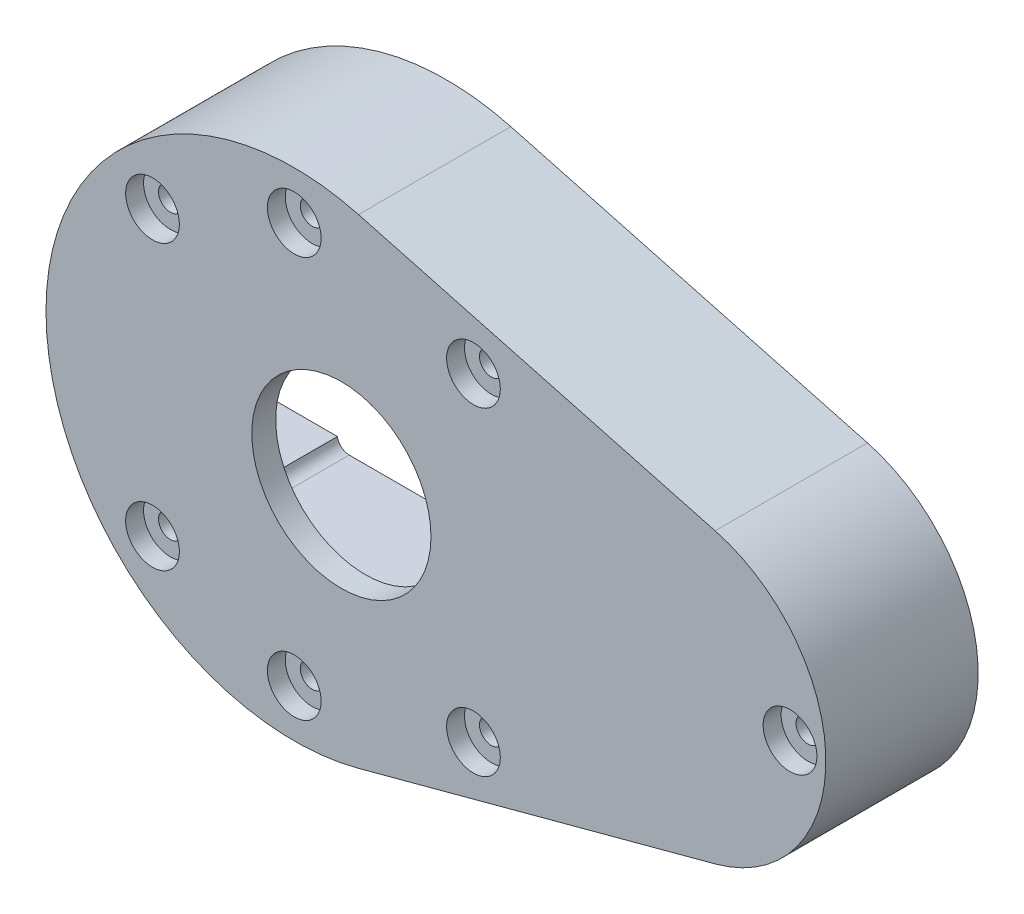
from build123d import *

# Parameters (mm, degrees)
SKETCH1_R           = 1
BOSS_EXTRUDE1_DEPTH = 12.75
BOSS_EXTRUDE2_START = -2
SKETCH2_R           = 1
BOSS_EXTRUDE2_DEPTH = 2
SKETCH3_R           = 7.5
CUT_EXTRUDE1_DEPTH  = 41.949636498
SKETCH4_R           = 2.25
CUT_EXTRUDE2_DEPTH  = 1.5


with BuildPart() as part:
    # Sketch1 → Boss-Extrude1 (new body)
    with BuildSketch(Plane.XY):
        with BuildLine():
            Line((23.635238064, 12.074072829), (-6.221168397, 20.074072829))
            ThreePointArc((-6.221168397, 20.074072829), (-32.382209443, 0), (-6.221168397, -20.074072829))
            Line((-6.221168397, -20.074072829), (23.635238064, -12.074072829))
            ThreePointArc((23.635238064, -12.074072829), (32.9, 0), (23.635238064, 12.074072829))
        make_face()
        with Locations((-23.466814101, -11.866814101)):
            Circle(SKETCH1_R, mode=Mode.SUBTRACT)
        with Locations((-11.6, -16.782209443)):
            Circle(SKETCH1_R, mode=Mode.SUBTRACT)
        with BuildLine():
            Line((27.75, 6.225), (27.75, -6.225))
            Line((27.75, -6.225), (27.75, -7.65))
            ThreePointArc((27.75, -7.65), (27.164213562, -9.064213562), (25.75, -9.65))
            Line((25.75, -9.65), (20.738685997, -9.65))
            ThreePointArc((20.738685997, -9.65), (20.401920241, -10.258287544), (19.75, -10.5))
            Line((19.75, -10.5), (-8.260025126, -10.5))
            Line((-8.260025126, -10.5), (-10.25, -10.5))
            Line((-10.25, -10.5), (-12.239974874, -10.5))
            Line((-12.239974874, -10.5), (-19.75, -10.5))
            ThreePointArc((-19.75, -10.5), (-20.401920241, -10.258287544), (-20.738685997, -9.65))
            Line((-20.738685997, -9.65), (-25.75, -9.65))
            ThreePointArc((-25.75, -9.65), (-27.164213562, -9.064213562), (-27.75, -7.65))
            Line((-27.75, -7.65), (-27.75, -6.225))
            Line((-27.75, -6.225), (-27.75, 6.225))
            Line((-27.75, 6.225), (-27.75, 7.65))
            ThreePointArc((-27.75, 7.65), (-27.164213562, 9.064213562), (-25.75, 9.65))
            Line((-25.75, 9.65), (-20.738685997, 9.65))
            ThreePointArc((-20.738685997, 9.65), (-20.401920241, 10.258287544), (-19.75, 10.5))
            Line((-19.75, 10.5), (-12.239974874, 10.5))
            Line((-12.239974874, 10.5), (-10.25, 10.5))
            Line((-10.25, 10.5), (-8.260025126, 10.5))
            Line((-8.260025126, 10.5), (19.75, 10.5))
            ThreePointArc((19.75, 10.5), (20.401920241, 10.258287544), (20.738685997, 9.65))
            Line((20.738685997, 9.65), (25.75, 9.65))
            ThreePointArc((25.75, 9.65), (27.164213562, 9.064213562), (27.75, 7.65))
            Line((27.75, 7.65), (27.75, 6.225))
        make_face(mode=Mode.SUBTRACT)
        with Locations((3.4, -13.354983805)):
            Circle(SKETCH1_R, mode=Mode.SUBTRACT)
        with Locations((-23.466814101, 11.866814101)):
            Circle(SKETCH1_R, mode=Mode.SUBTRACT)
        with Locations((-11.6, 16.782209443)):
            Circle(SKETCH1_R, mode=Mode.SUBTRACT)
        with Locations((29.9, 0)):
            Circle(SKETCH1_R, mode=Mode.SUBTRACT)
        with Locations((3.4, 13.354983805)):
            Circle(SKETCH1_R, mode=Mode.SUBTRACT)
    extrude(amount=BOSS_EXTRUDE1_DEPTH)

    # Sketch2 → Boss-Extrude2 (add)
    with BuildSketch(Plane.XY.offset(12.75).offset(BOSS_EXTRUDE2_START)):
        with BuildLine():
            Line((23.635238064, 12.074072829), (-6.221168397, 20.074072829))
            ThreePointArc((-6.221168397, 20.074072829), (-32.382209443, 0), (-6.221168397, -20.074072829))
            Line((-6.221168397, -20.074072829), (23.635238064, -12.074072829))
            ThreePointArc((23.635238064, -12.074072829), (32.9, 0), (23.635238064, 12.074072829))
        make_face()
        with Locations((-11.6, 16.782209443)):
            Circle(SKETCH2_R, mode=Mode.SUBTRACT)
        with Locations((3.4, 13.354983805)):
            Circle(SKETCH2_R, mode=Mode.SUBTRACT)
        with Locations((29.9, 0)):
            Circle(SKETCH2_R, mode=Mode.SUBTRACT)
        with Locations((3.4, -13.354983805)):
            Circle(SKETCH2_R, mode=Mode.SUBTRACT)
        with Locations((-11.6, -16.782209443)):
            Circle(SKETCH2_R, mode=Mode.SUBTRACT)
        with Locations((-23.466814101, -11.866814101)):
            Circle(SKETCH2_R, mode=Mode.SUBTRACT)
        with Locations((-23.466814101, 11.866814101)):
            Circle(SKETCH2_R, mode=Mode.SUBTRACT)
    extrude(amount=BOSS_EXTRUDE2_DEPTH)

    # Sketch3 → Cut-Extrude1 (cut, through all)
    with BuildSketch(Plane.XY.offset(12.75)):
        with Locations((-7.655940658, -0.25)):
            Circle(SKETCH3_R)
    extrude(amount=-CUT_EXTRUDE1_DEPTH, mode=Mode.SUBTRACT)

    # Sketch4 → Cut-Extrude2 (cut)
    with BuildSketch(Plane.XY.offset(12.75)):
        with Locations((-11.6, 16.782209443)):
            Circle(SKETCH4_R)
        with Locations((3.4, 13.354983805)):
            Circle(SKETCH4_R)
        with Locations((29.9, 0)):
            Circle(SKETCH4_R)
        with Locations((3.4, -13.354983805)):
            Circle(SKETCH4_R)
        with Locations((-11.6, -16.782209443)):
            Circle(SKETCH4_R)
        with Locations((-23.466814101, -11.866814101)):
            Circle(SKETCH4_R)
        with Locations((-23.466814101, 11.866814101)):
            Circle(SKETCH4_R)
    extrude(amount=-CUT_EXTRUDE2_DEPTH, mode=Mode.SUBTRACT)


solid = part.part
